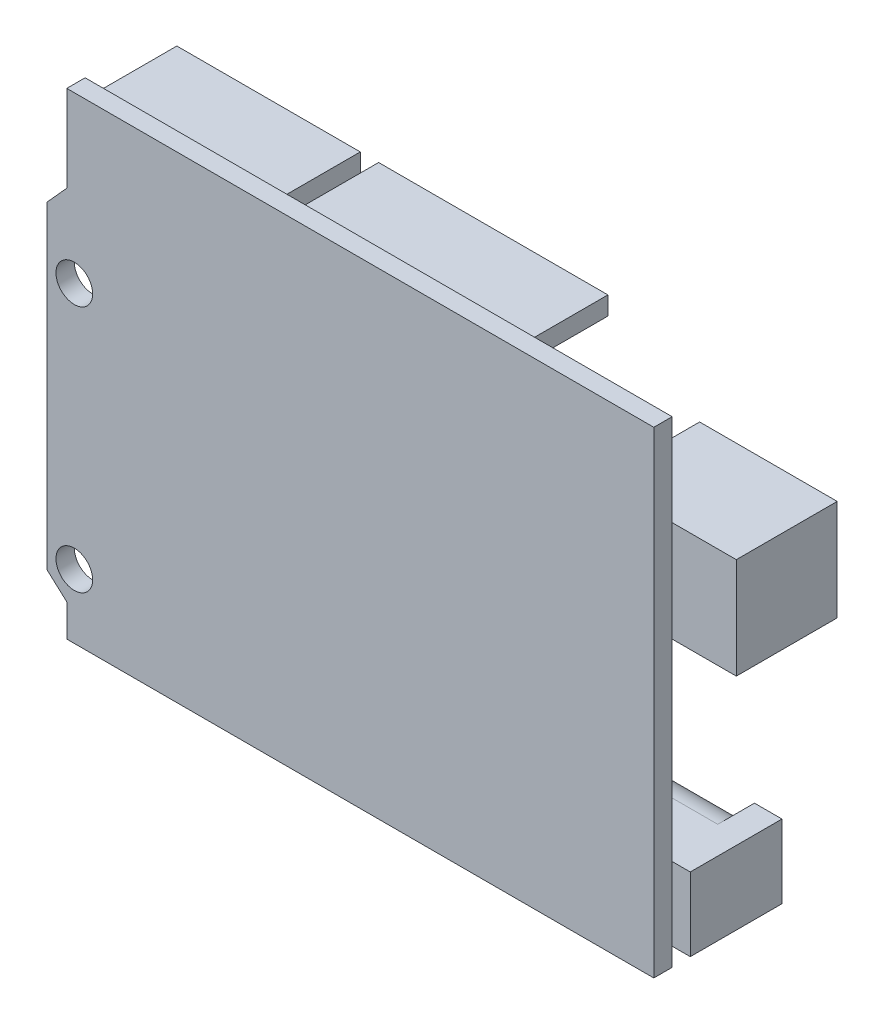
ISO-10303-21;
HEADER;
FILE_DESCRIPTION(('STEP AP214'),'2;1');
FILE_NAME('part.step','',(''),(''),'','','');
FILE_SCHEMA(('AUTOMOTIVE_DESIGN { 1 0 10303 214 1 1 1 1 }'));
ENDSEC;
DATA;
#1=APPLICATION_CONTEXT('core data for automotive mechanical design processes');
#2=APPLICATION_PROTOCOL_DEFINITION('international standard','automotive_design',2000,#1);
#3=PRODUCT_CONTEXT('',#1,'mechanical');
#4=PRODUCT('Part','Part','',(#3));
#5=PRODUCT_RELATED_PRODUCT_CATEGORY('part','',(#4));
#6=PRODUCT_DEFINITION_FORMATION('','',#4);
#7=PRODUCT_DEFINITION_CONTEXT('part definition',#1,'design');
#8=PRODUCT_DEFINITION('design','',#6,#7);
#9=PRODUCT_DEFINITION_SHAPE('','',#8);
#10=(LENGTH_UNIT() NAMED_UNIT(*) SI_UNIT(.MILLI.,.METRE.));
#11=(NAMED_UNIT(*) PLANE_ANGLE_UNIT() SI_UNIT($,.RADIAN.));
#12=(NAMED_UNIT(*) SI_UNIT($,.STERADIAN.) SOLID_ANGLE_UNIT());
#13=UNCERTAINTY_MEASURE_WITH_UNIT(LENGTH_MEASURE(1.E-05),#10,'distance_accuracy_value','');
#14=(GEOMETRIC_REPRESENTATION_CONTEXT(3) GLOBAL_UNCERTAINTY_ASSIGNED_CONTEXT((#13)) GLOBAL_UNIT_ASSIGNED_CONTEXT((#10,
#11,#12)) REPRESENTATION_CONTEXT('',''));
#15=CARTESIAN_POINT('',(0.,0.,0.));
#16=DIRECTION('',(0.,0.,1.));
#17=DIRECTION('',(1.,0.,0.));
#18=AXIS2_PLACEMENT_3D('',#15,#16,#17);
#19=CARTESIAN_POINT('',(52.9767933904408,-42.,-10.));
#20=DIRECTION('',(1.,0.,0.));
#21=DIRECTION('',(0.,0.,-1.));
#22=AXIS2_PLACEMENT_3D('',#19,#20,#21);
#23=PLANE('',#22);
#24=DIRECTION('',(0.,0.,1.));
#25=VECTOR('',#24,1.);
#26=CARTESIAN_POINT('',(52.9767933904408,-42.,-10.));
#27=LINE('',#26,#25);
#28=CARTESIAN_POINT('',(52.9767933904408,-42.,-6.));
#29=VERTEX_POINT('',#28);
#30=CARTESIAN_POINT('',(52.9767933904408,-42.,0.));
#31=VERTEX_POINT('',#30);
#32=EDGE_CURVE('E314',#29,#31,#27,.T.);
#33=ORIENTED_EDGE('',*,*,#32,.F.);
#34=CARTESIAN_POINT('',(52.9767933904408,-46.,-6.));
#35=DIRECTION('',(1.,0.,0.));
#36=DIRECTION('',(0.,0.,1.));
#37=AXIS2_PLACEMENT_3D('',#34,#35,#36);
#38=CIRCLE('',#37,4.);
#39=CARTESIAN_POINT('',(52.9767933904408,-50.,-6.));
#40=VERTEX_POINT('',#39);
#41=EDGE_CURVE('E274',#40,#29,#38,.T.);
#42=ORIENTED_EDGE('',*,*,#41,.F.);
#43=DIRECTION('',(0.,0.,1.));
#44=VECTOR('',#43,1.);
#45=CARTESIAN_POINT('',(52.9767933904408,-50.,-10.));
#46=LINE('',#45,#44);
#47=CARTESIAN_POINT('',(52.9767933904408,-50.,0.));
#48=VERTEX_POINT('',#47);
#49=EDGE_CURVE('E316',#40,#48,#46,.T.);
#50=ORIENTED_EDGE('',*,*,#49,.T.);
#51=DIRECTION('',(0.,1.,0.));
#52=VECTOR('',#51,1.);
#53=CARTESIAN_POINT('',(52.9767933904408,-42.,0.));
#54=LINE('',#53,#52);
#55=EDGE_CURVE('E307',#48,#31,#54,.T.);
#56=ORIENTED_EDGE('',*,*,#55,.T.);
#57=EDGE_LOOP('',(#33,#42,#50,#56));
#58=FACE_BOUND('',#57,.T.);
#59=ADVANCED_FACE('F33',(#58),#23,.F.);
#60=CARTESIAN_POINT('',(0.,0.,-10.));
#61=DIRECTION('',(0.,0.,-1.));
#62=DIRECTION('',(-1.,0.,0.));
#63=AXIS2_PLACEMENT_3D('',#60,#61,#62);
#64=PLANE('',#63);
#65=DIRECTION('',(-1.,0.,0.));
#66=VECTOR('',#65,1.);
#67=CARTESIAN_POINT('',(65.9767933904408,-50.,-10.));
#68=LINE('',#67,#66);
#69=CARTESIAN_POINT('',(65.9767933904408,-50.,-10.));
#70=VERTEX_POINT('',#69);
#71=CARTESIAN_POINT('',(62.9767933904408,-50.,-10.));
#72=VERTEX_POINT('',#71);
#73=EDGE_CURVE('E296',#70,#72,#68,.T.);
#74=ORIENTED_EDGE('',*,*,#73,.T.);
#75=DIRECTION('',(0.,1.,0.));
#76=VECTOR('',#75,1.);
#77=CARTESIAN_POINT('',(62.9767933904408,0.,-10.));
#78=LINE('',#77,#76);
#79=CARTESIAN_POINT('',(62.9767933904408,-46.,-10.));
#80=VERTEX_POINT('',#79);
#81=EDGE_CURVE('E11',#72,#80,#78,.T.);
#82=ORIENTED_EDGE('',*,*,#81,.T.);
#83=CARTESIAN_POINT('',(62.9767933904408,-42.,-10.));
#84=VERTEX_POINT('',#83);
#85=EDGE_CURVE('E37',#80,#84,#78,.T.);
#86=ORIENTED_EDGE('',*,*,#85,.T.);
#87=DIRECTION('',(1.,0.,0.));
#88=VECTOR('',#87,1.);
#89=CARTESIAN_POINT('',(65.9767933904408,-42.,-10.));
#90=LINE('',#89,#88);
#91=CARTESIAN_POINT('',(65.9767933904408,-42.,-10.));
#92=VERTEX_POINT('',#91);
#93=EDGE_CURVE('E286',#84,#92,#90,.T.);
#94=ORIENTED_EDGE('',*,*,#93,.T.);
#95=DIRECTION('',(0.,-1.,0.));
#96=VECTOR('',#95,1.);
#97=CARTESIAN_POINT('',(65.9767933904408,-42.,-10.));
#98=LINE('',#97,#96);
#99=EDGE_CURVE('E293',#92,#70,#98,.T.);
#100=ORIENTED_EDGE('',*,*,#99,.T.);
#101=EDGE_LOOP('',(#74,#82,#86,#94,#100));
#102=FACE_BOUND('',#101,.T.);
#103=ADVANCED_FACE('F569',(#102),#64,.T.);
#104=CARTESIAN_POINT('',(0.,0.,0.));
#105=DIRECTION('',(0.,0.,1.));
#106=DIRECTION('',(1.,0.,0.));
#107=AXIS2_PLACEMENT_3D('',#104,#105,#106);
#108=PLANE('',#107);
#109=DIRECTION('',(0.,1.,0.));
#110=VECTOR('',#109,1.);
#111=CARTESIAN_POINT('',(18.,-49.,0.));
#112=LINE('',#111,#110);
#113=CARTESIAN_POINT('',(18.,-51.,0.));
#114=VERTEX_POINT('',#113);
#115=CARTESIAN_POINT('',(18.,-49.,0.));
#116=VERTEX_POINT('',#115);
#117=EDGE_CURVE('E353',#114,#116,#112,.T.);
#118=ORIENTED_EDGE('',*,*,#117,.F.);
#119=DIRECTION('',(-1.,0.,0.));
#120=VECTOR('',#119,1.);
#121=CARTESIAN_POINT('',(18.,-51.,0.));
#122=LINE('',#121,#120);
#123=CARTESIAN_POINT('',(38.,-51.,0.));
#124=VERTEX_POINT('',#123);
#125=EDGE_CURVE('E364',#124,#114,#122,.T.);
#126=ORIENTED_EDGE('',*,*,#125,.F.);
#127=DIRECTION('',(0.,-1.,0.));
#128=VECTOR('',#127,1.);
#129=CARTESIAN_POINT('',(38.,-49.,0.));
#130=LINE('',#129,#128);
#131=CARTESIAN_POINT('',(38.,-49.,0.));
#132=VERTEX_POINT('',#131);
#133=EDGE_CURVE('E376',#132,#124,#130,.T.);
#134=ORIENTED_EDGE('',*,*,#133,.F.);
#135=DIRECTION('',(1.,0.,0.));
#136=VECTOR('',#135,1.);
#137=CARTESIAN_POINT('',(18.,-49.,0.));
#138=LINE('',#137,#136);
#139=EDGE_CURVE('E373',#116,#132,#138,.T.);
#140=ORIENTED_EDGE('',*,*,#139,.F.);
#141=EDGE_LOOP('',(#118,#126,#134,#140));
#142=FACE_BOUND('',#141,.T.);
#143=DIRECTION('',(0.,1.,0.));
#144=VECTOR('',#143,1.);
#145=CARTESIAN_POINT('',(23.,-1.,0.));
#146=LINE('',#145,#144);
#147=CARTESIAN_POINT('',(23.,-3.,0.));
#148=VERTEX_POINT('',#147);
#149=CARTESIAN_POINT('',(23.,-1.,0.));
#150=VERTEX_POINT('',#149);
#151=EDGE_CURVE('E425',#148,#150,#146,.T.);
#152=ORIENTED_EDGE('',*,*,#151,.F.);
#153=DIRECTION('',(-1.,0.,0.));
#154=VECTOR('',#153,1.);
#155=CARTESIAN_POINT('',(23.,-3.,0.));
#156=LINE('',#155,#154);
#157=CARTESIAN_POINT('',(48.,-3.,0.));
#158=VERTEX_POINT('',#157);
#159=EDGE_CURVE('E430',#158,#148,#156,.T.);
#160=ORIENTED_EDGE('',*,*,#159,.F.);
#161=DIRECTION('',(0.,-1.,0.));
#162=VECTOR('',#161,1.);
#163=CARTESIAN_POINT('',(48.,-1.,0.));
#164=LINE('',#163,#162);
#165=CARTESIAN_POINT('',(48.,-1.,0.));
#166=VERTEX_POINT('',#165);
#167=EDGE_CURVE('E442',#166,#158,#164,.T.);
#168=ORIENTED_EDGE('',*,*,#167,.F.);
#169=DIRECTION('',(1.,0.,0.));
#170=VECTOR('',#169,1.);
#171=CARTESIAN_POINT('',(23.,-1.,0.));
#172=LINE('',#171,#170);
#173=EDGE_CURVE('E439',#150,#166,#172,.T.);
#174=ORIENTED_EDGE('',*,*,#173,.F.);
#175=EDGE_LOOP('',(#152,#160,#168,#174));
#176=FACE_BOUND('',#175,.T.);
#177=DIRECTION('',(0.,-1.,0.));
#178=VECTOR('',#177,1.);
#179=CARTESIAN_POINT('',(21.,-1.,0.));
#180=LINE('',#179,#178);
#181=CARTESIAN_POINT('',(21.,-1.,0.));
#182=VERTEX_POINT('',#181);
#183=CARTESIAN_POINT('',(21.,-3.,0.));
#184=VERTEX_POINT('',#183);
#185=EDGE_CURVE('E458',#182,#184,#180,.T.);
#186=ORIENTED_EDGE('',*,*,#185,.F.);
#187=DIRECTION('',(1.,0.,0.));
#188=VECTOR('',#187,1.);
#189=CARTESIAN_POINT('',(21.,-1.,0.));
#190=LINE('',#189,#188);
#191=CARTESIAN_POINT('',(1.,-1.,0.));
#192=VERTEX_POINT('',#191);
#193=EDGE_CURVE('E463',#192,#182,#190,.T.);
#194=ORIENTED_EDGE('',*,*,#193,.F.);
#195=DIRECTION('',(0.,1.,0.));
#196=VECTOR('',#195,1.);
#197=CARTESIAN_POINT('',(1.,-1.,0.));
#198=LINE('',#197,#196);
#199=CARTESIAN_POINT('',(1.,-3.,0.));
#200=VERTEX_POINT('',#199);
#201=EDGE_CURVE('E475',#200,#192,#198,.T.);
#202=ORIENTED_EDGE('',*,*,#201,.F.);
#203=DIRECTION('',(-1.,0.,0.));
#204=VECTOR('',#203,1.);
#205=CARTESIAN_POINT('',(21.,-3.,0.));
#206=LINE('',#205,#204);
#207=EDGE_CURVE('E472',#184,#200,#206,.T.);
#208=ORIENTED_EDGE('',*,*,#207,.F.);
#209=EDGE_LOOP('',(#186,#194,#202,#208));
#210=FACE_BOUND('',#209,.T.);
#211=DIRECTION('',(0.,-1.,0.));
#212=VECTOR('',#211,1.);
#213=CARTESIAN_POINT('',(16.,-49.,0.));
#214=LINE('',#213,#212);
#215=CARTESIAN_POINT('',(16.,-49.,0.));
#216=VERTEX_POINT('',#215);
#217=CARTESIAN_POINT('',(16.,-51.,0.));
#218=VERTEX_POINT('',#217);
#219=EDGE_CURVE('E392',#216,#218,#214,.T.);
#220=ORIENTED_EDGE('',*,*,#219,.F.);
#221=DIRECTION('',(1.,0.,0.));
#222=VECTOR('',#221,1.);
#223=CARTESIAN_POINT('',(16.,-49.,0.));
#224=LINE('',#223,#222);
#225=CARTESIAN_POINT('',(1.,-49.,0.));
#226=VERTEX_POINT('',#225);
#227=EDGE_CURVE('E397',#226,#216,#224,.T.);
#228=ORIENTED_EDGE('',*,*,#227,.F.);
#229=DIRECTION('',(0.,1.,0.));
#230=VECTOR('',#229,1.);
#231=CARTESIAN_POINT('',(1.,-49.,0.));
#232=LINE('',#231,#230);
#233=CARTESIAN_POINT('',(1.,-51.,0.));
#234=VERTEX_POINT('',#233);
#235=EDGE_CURVE('E409',#234,#226,#232,.T.);
#236=ORIENTED_EDGE('',*,*,#235,.F.);
#237=DIRECTION('',(-1.,0.,0.));
#238=VECTOR('',#237,1.);
#239=CARTESIAN_POINT('',(16.,-51.,0.));
#240=LINE('',#239,#238);
#241=EDGE_CURVE('E406',#218,#234,#240,.T.);
#242=ORIENTED_EDGE('',*,*,#241,.F.);
#243=EDGE_LOOP('',(#220,#228,#236,#242));
#244=FACE_BOUND('',#243,.T.);
#245=CARTESIAN_POINT('',(0.821732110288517,-45.,0.));
#246=DIRECTION('',(0.,0.,-1.));
#247=DIRECTION('',(-1.,0.,0.));
#248=AXIS2_PLACEMENT_3D('',#245,#246,#247);
#249=CIRCLE('',#248,2.);
#250=CARTESIAN_POINT('',(-1.17826788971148,-45.,0.));
#251=VERTEX_POINT('',#250);
#252=EDGE_CURVE('E321',#251,#251,#249,.T.);
#253=ORIENTED_EDGE('',*,*,#252,.F.);
#254=EDGE_LOOP('',(#253));
#255=FACE_BOUND('',#254,.T.);
#256=CARTESIAN_POINT('',(0.821732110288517,-18.,0.));
#257=DIRECTION('',(0.,0.,-1.));
#258=DIRECTION('',(-1.,0.,0.));
#259=AXIS2_PLACEMENT_3D('',#256,#257,#258);
#260=CIRCLE('',#259,2.);
#261=CARTESIAN_POINT('',(-1.17826788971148,-18.,0.));
#262=VERTEX_POINT('',#261);
#263=EDGE_CURVE('E326',#262,#262,#260,.T.);
#264=ORIENTED_EDGE('',*,*,#263,.F.);
#265=EDGE_LOOP('',(#264));
#266=FACE_BOUND('',#265,.T.);
#267=DIRECTION('',(-1.,0.,0.));
#268=VECTOR('',#267,1.);
#269=CARTESIAN_POINT('',(65.9767933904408,-50.,0.));
#270=LINE('',#269,#268);
#271=CARTESIAN_POINT('',(64.,-50.,0.));
#272=VERTEX_POINT('',#271);
#273=EDGE_CURVE('E303',#272,#48,#270,.T.);
#274=ORIENTED_EDGE('',*,*,#273,.F.);
#275=DIRECTION('',(0.,1.,0.));
#276=VECTOR('',#275,1.);
#277=CARTESIAN_POINT('',(64.,0.,0.));
#278=LINE('',#277,#276);
#279=CARTESIAN_POINT('',(64.,-52.,0.));
#280=VERTEX_POINT('',#279);
#281=EDGE_CURVE('E544',#280,#272,#278,.T.);
#282=ORIENTED_EDGE('',*,*,#281,.F.);
#283=DIRECTION('',(1.,0.,0.));
#284=VECTOR('',#283,1.);
#285=CARTESIAN_POINT('',(0.,-52.,0.));
#286=LINE('',#285,#284);
#287=CARTESIAN_POINT('',(0.,-52.,0.));
#288=VERTEX_POINT('',#287);
#289=EDGE_CURVE('E541',#288,#280,#286,.T.);
#290=ORIENTED_EDGE('',*,*,#289,.F.);
#291=DIRECTION('',(0.,-1.,0.));
#292=VECTOR('',#291,1.);
#293=CARTESIAN_POINT('',(0.,0.,0.));
#294=LINE('',#293,#292);
#295=CARTESIAN_POINT('',(0.,-48.4792406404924,0.));
#296=VERTEX_POINT('',#295);
#297=EDGE_CURVE('E526',#296,#288,#294,.T.);
#298=ORIENTED_EDGE('',*,*,#297,.F.);
#299=DIRECTION('',(-0.742560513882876,0.669778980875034,0.));
#300=VECTOR('',#299,1.);
#301=CARTESIAN_POINT('',(0.,-48.4792406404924,0.));
#302=LINE('',#301,#300);
#303=CARTESIAN_POINT('',(-2.17826788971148,-46.514474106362,0.));
#304=VERTEX_POINT('',#303);
#305=EDGE_CURVE('E325',#296,#304,#302,.T.);
#306=ORIENTED_EDGE('',*,*,#305,.T.);
#307=DIRECTION('',(0.,1.,0.));
#308=VECTOR('',#307,1.);
#309=CARTESIAN_POINT('',(-2.17826788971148,-46.514474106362,0.));
#310=LINE('',#309,#308);
#311=CARTESIAN_POINT('',(-2.17826788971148,-11.8421235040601,0.));
#312=VERTEX_POINT('',#311);
#313=EDGE_CURVE('E346',#304,#312,#310,.T.);
#314=ORIENTED_EDGE('',*,*,#313,.T.);
#315=DIRECTION('',(0.669778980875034,0.742560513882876,0.));
#316=VECTOR('',#315,1.);
#317=CARTESIAN_POINT('',(-2.17826788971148,-11.8421235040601,0.));
#318=LINE('',#317,#316);
#319=CARTESIAN_POINT('',(0.,-9.42715413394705,0.));
#320=VERTEX_POINT('',#319);
#321=EDGE_CURVE('E338',#312,#320,#318,.T.);
#322=ORIENTED_EDGE('',*,*,#321,.T.);
#323=CARTESIAN_POINT('',(0.,0.,0.));
#324=VERTEX_POINT('',#323);
#325=EDGE_CURVE('E538',#324,#320,#294,.T.);
#326=ORIENTED_EDGE('',*,*,#325,.F.);
#327=DIRECTION('',(-1.,0.,0.));
#328=VECTOR('',#327,1.);
#329=CARTESIAN_POINT('',(0.,0.,0.));
#330=LINE('',#329,#328);
#331=CARTESIAN_POINT('',(64.,0.,0.));
#332=VERTEX_POINT('',#331);
#333=EDGE_CURVE('E547',#332,#324,#330,.T.);
#334=ORIENTED_EDGE('',*,*,#333,.F.);
#335=CARTESIAN_POINT('',(64.,-9.99999999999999,0.));
#336=VERTEX_POINT('',#335);
#337=EDGE_CURVE('E543',#336,#332,#278,.T.);
#338=ORIENTED_EDGE('',*,*,#337,.F.);
#339=DIRECTION('',(1.,0.,0.));
#340=VECTOR('',#339,1.);
#341=CARTESIAN_POINT('',(70.9980395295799,-10.,0.));
#342=LINE('',#341,#340);
#343=CARTESIAN_POINT('',(55.9980395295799,-10.,0.));
#344=VERTEX_POINT('',#343);
#345=EDGE_CURVE('E496',#344,#336,#342,.T.);
#346=ORIENTED_EDGE('',*,*,#345,.F.);
#347=DIRECTION('',(0.,1.,0.));
#348=VECTOR('',#347,1.);
#349=CARTESIAN_POINT('',(55.9980395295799,-10.,0.));
#350=LINE('',#349,#348);
#351=CARTESIAN_POINT('',(55.9980395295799,-21.,0.));
#352=VERTEX_POINT('',#351);
#353=EDGE_CURVE('E508',#352,#344,#350,.T.);
#354=ORIENTED_EDGE('',*,*,#353,.F.);
#355=DIRECTION('',(-1.,0.,0.));
#356=VECTOR('',#355,1.);
#357=CARTESIAN_POINT('',(70.9980395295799,-21.,0.));
#358=LINE('',#357,#356);
#359=CARTESIAN_POINT('',(64.,-21.,0.));
#360=VERTEX_POINT('',#359);
#361=EDGE_CURVE('E509',#360,#352,#358,.T.);
#362=ORIENTED_EDGE('',*,*,#361,.F.);
#363=CARTESIAN_POINT('',(64.,-42.,0.));
#364=VERTEX_POINT('',#363);
#365=EDGE_CURVE('E549',#364,#360,#278,.T.);
#366=ORIENTED_EDGE('',*,*,#365,.F.);
#367=DIRECTION('',(1.,0.,0.));
#368=VECTOR('',#367,1.);
#369=CARTESIAN_POINT('',(65.9767933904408,-42.,0.));
#370=LINE('',#369,#368);
#371=EDGE_CURVE('E56',#31,#364,#370,.T.);
#372=ORIENTED_EDGE('',*,*,#371,.F.);
#373=ORIENTED_EDGE('',*,*,#55,.F.);
#374=EDGE_LOOP('',(#274,#282,#290,#298,#306,#314,#322,#326,#334,#338,#346,#354,#362,#366,#372,#373));
#375=FACE_BOUND('',#374,.T.);
#376=ADVANCED_FACE('F584',(#142,#176,#210,#244,#255,#266,#375),#108,.F.);
#377=CARTESIAN_POINT('',(0.,0.,2.));
#378=DIRECTION('',(1.,0.,0.));
#379=DIRECTION('',(0.,1.,0.));
#380=AXIS2_PLACEMENT_3D('',#377,#378,#379);
#381=PLANE('',#380);
#382=DIRECTION('',(0.,0.,-1.));
#383=VECTOR('',#382,1.);
#384=CARTESIAN_POINT('',(0.,-9.42715413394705,2.));
#385=LINE('',#384,#383);
#386=CARTESIAN_POINT('',(0.,-9.42715413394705,2.));
#387=VERTEX_POINT('',#386);
#388=EDGE_CURVE('E351',#387,#320,#385,.T.);
#389=ORIENTED_EDGE('',*,*,#388,.F.);
#390=DIRECTION('',(0.,-1.,0.));
#391=VECTOR('',#390,1.);
#392=CARTESIAN_POINT('',(0.,0.,2.));
#393=LINE('',#392,#391);
#394=CARTESIAN_POINT('',(0.,0.,2.));
#395=VERTEX_POINT('',#394);
#396=EDGE_CURVE('E527',#395,#387,#393,.T.);
#397=ORIENTED_EDGE('',*,*,#396,.F.);
#398=DIRECTION('',(0.,0.,-1.));
#399=VECTOR('',#398,1.);
#400=CARTESIAN_POINT('',(0.,0.,2.));
#401=LINE('',#400,#399);
#402=EDGE_CURVE('E537',#395,#324,#401,.T.);
#403=ORIENTED_EDGE('',*,*,#402,.T.);
#404=ORIENTED_EDGE('',*,*,#325,.T.);
#405=EDGE_LOOP('',(#389,#397,#403,#404));
#406=FACE_BOUND('',#405,.T.);
#407=ADVANCED_FACE('F933',(#406),#381,.F.);
#408=CARTESIAN_POINT('',(0.,-48.4792406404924,2.));
#409=VERTEX_POINT('',#408);
#410=CARTESIAN_POINT('',(0.,-52.,2.));
#411=VERTEX_POINT('',#410);
#412=EDGE_CURVE('E531',#409,#411,#393,.T.);
#413=ORIENTED_EDGE('',*,*,#412,.F.);
#414=DIRECTION('',(0.,0.,-1.));
#415=VECTOR('',#414,1.);
#416=CARTESIAN_POINT('',(0.,-48.4792406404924,2.));
#417=LINE('',#416,#415);
#418=EDGE_CURVE('E343',#409,#296,#417,.T.);
#419=ORIENTED_EDGE('',*,*,#418,.T.);
#420=ORIENTED_EDGE('',*,*,#297,.T.);
#421=DIRECTION('',(0.,0.,-1.));
#422=VECTOR('',#421,1.);
#423=CARTESIAN_POINT('',(0.,-52.,2.));
#424=LINE('',#423,#422);
#425=EDGE_CURVE('E559',#411,#288,#424,.T.);
#426=ORIENTED_EDGE('',*,*,#425,.F.);
#427=EDGE_LOOP('',(#413,#419,#420,#426));
#428=FACE_BOUND('',#427,.T.);
#429=ADVANCED_FACE('F35',(#428),#381,.F.);
#430=CARTESIAN_POINT('',(0.,-52.,2.));
#431=DIRECTION('',(0.,1.,0.));
#432=DIRECTION('',(0.,0.,1.));
#433=AXIS2_PLACEMENT_3D('',#430,#431,#432);
#434=PLANE('',#433);
#435=ORIENTED_EDGE('',*,*,#289,.T.);
#436=DIRECTION('',(0.,0.,-1.));
#437=VECTOR('',#436,1.);
#438=CARTESIAN_POINT('',(64.,-52.,2.));
#439=LINE('',#438,#437);
#440=CARTESIAN_POINT('',(64.,-52.,2.));
#441=VERTEX_POINT('',#440);
#442=EDGE_CURVE('E557',#441,#280,#439,.T.);
#443=ORIENTED_EDGE('',*,*,#442,.F.);
#444=DIRECTION('',(1.,0.,0.));
#445=VECTOR('',#444,1.);
#446=CARTESIAN_POINT('',(0.,-52.,2.));
#447=LINE('',#446,#445);
#448=EDGE_CURVE('E530',#411,#441,#447,.T.);
#449=ORIENTED_EDGE('',*,*,#448,.F.);
#450=ORIENTED_EDGE('',*,*,#425,.T.);
#451=EDGE_LOOP('',(#435,#443,#449,#450));
#452=FACE_BOUND('',#451,.T.);
#453=ADVANCED_FACE('F944',(#452),#434,.F.);
#454=CARTESIAN_POINT('',(64.,0.,2.));
#455=DIRECTION('',(-1.,0.,0.));
#456=DIRECTION('',(0.,0.,1.));
#457=AXIS2_PLACEMENT_3D('',#454,#455,#456);
#458=PLANE('',#457);
#459=ORIENTED_EDGE('',*,*,#281,.T.);
#460=EDGE_CURVE('E548',#272,#364,#278,.T.);
#461=ORIENTED_EDGE('',*,*,#460,.T.);
#462=ORIENTED_EDGE('',*,*,#365,.T.);
#463=EDGE_CURVE('E550',#360,#336,#278,.T.);
#464=ORIENTED_EDGE('',*,*,#463,.T.);
#465=ORIENTED_EDGE('',*,*,#337,.T.);
#466=DIRECTION('',(0.,0.,-1.));
#467=VECTOR('',#466,1.);
#468=CARTESIAN_POINT('',(64.,0.,2.));
#469=LINE('',#468,#467);
#470=CARTESIAN_POINT('',(64.,0.,2.));
#471=VERTEX_POINT('',#470);
#472=EDGE_CURVE('E554',#471,#332,#469,.T.);
#473=ORIENTED_EDGE('',*,*,#472,.F.);
#474=DIRECTION('',(0.,1.,0.));
#475=VECTOR('',#474,1.);
#476=CARTESIAN_POINT('',(64.,0.,2.));
#477=LINE('',#476,#475);
#478=EDGE_CURVE('E533',#441,#471,#477,.T.);
#479=ORIENTED_EDGE('',*,*,#478,.F.);
#480=ORIENTED_EDGE('',*,*,#442,.T.);
#481=EDGE_LOOP('',(#459,#461,#462,#464,#465,#473,#479,#480));
#482=FACE_BOUND('',#481,.T.);
#483=ADVANCED_FACE('F589',(#482),#458,.F.);
#484=CARTESIAN_POINT('',(0.,0.,2.));
#485=DIRECTION('',(0.,-1.,0.));
#486=DIRECTION('',(0.,0.,-1.));
#487=AXIS2_PLACEMENT_3D('',#484,#485,#486);
#488=PLANE('',#487);
#489=ORIENTED_EDGE('',*,*,#333,.T.);
#490=ORIENTED_EDGE('',*,*,#402,.F.);
#491=DIRECTION('',(-1.,0.,0.));
#492=VECTOR('',#491,1.);
#493=CARTESIAN_POINT('',(0.,0.,2.));
#494=LINE('',#493,#492);
#495=EDGE_CURVE('E535',#471,#395,#494,.T.);
#496=ORIENTED_EDGE('',*,*,#495,.F.);
#497=ORIENTED_EDGE('',*,*,#472,.T.);
#498=EDGE_LOOP('',(#489,#490,#496,#497));
#499=FACE_BOUND('',#498,.T.);
#500=ADVANCED_FACE('F621',(#499),#488,.F.);
#501=CARTESIAN_POINT('',(0.,0.,2.));
#502=DIRECTION('',(0.,0.,1.));
#503=DIRECTION('',(1.,0.,0.));
#504=AXIS2_PLACEMENT_3D('',#501,#502,#503);
#505=PLANE('',#504);
#506=CARTESIAN_POINT('',(0.821732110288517,-18.,2.));
#507=DIRECTION('',(0.,0.,-1.));
#508=DIRECTION('',(-1.,0.,0.));
#509=AXIS2_PLACEMENT_3D('',#506,#507,#508);
#510=CIRCLE('',#509,2.);
#511=CARTESIAN_POINT('',(-1.17826788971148,-18.,2.));
#512=VERTEX_POINT('',#511);
#513=EDGE_CURVE('E322',#512,#512,#510,.T.);
#514=ORIENTED_EDGE('',*,*,#513,.T.);
#515=EDGE_LOOP('',(#514));
#516=FACE_BOUND('',#515,.T.);
#517=CARTESIAN_POINT('',(0.821732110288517,-45.,2.));
#518=DIRECTION('',(0.,0.,-1.));
#519=DIRECTION('',(-1.,0.,0.));
#520=AXIS2_PLACEMENT_3D('',#517,#518,#519);
#521=CIRCLE('',#520,2.);
#522=CARTESIAN_POINT('',(-1.17826788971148,-45.,2.));
#523=VERTEX_POINT('',#522);
#524=EDGE_CURVE('E329',#523,#523,#521,.T.);
#525=ORIENTED_EDGE('',*,*,#524,.T.);
#526=EDGE_LOOP('',(#525));
#527=FACE_BOUND('',#526,.T.);
#528=ORIENTED_EDGE('',*,*,#396,.T.);
#529=DIRECTION('',(0.669778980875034,0.742560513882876,0.));
#530=VECTOR('',#529,1.);
#531=CARTESIAN_POINT('',(-2.17826788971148,-11.8421235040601,2.));
#532=LINE('',#531,#530);
#533=CARTESIAN_POINT('',(-2.17826788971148,-11.8421235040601,2.));
#534=VERTEX_POINT('',#533);
#535=EDGE_CURVE('E341',#534,#387,#532,.T.);
#536=ORIENTED_EDGE('',*,*,#535,.F.);
#537=DIRECTION('',(0.,1.,0.));
#538=VECTOR('',#537,1.);
#539=CARTESIAN_POINT('',(-2.17826788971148,-46.514474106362,2.));
#540=LINE('',#539,#538);
#541=CARTESIAN_POINT('',(-2.17826788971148,-46.514474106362,2.));
#542=VERTEX_POINT('',#541);
#543=EDGE_CURVE('E337',#542,#534,#540,.T.);
#544=ORIENTED_EDGE('',*,*,#543,.F.);
#545=DIRECTION('',(-0.742560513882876,0.669778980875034,0.));
#546=VECTOR('',#545,1.);
#547=CARTESIAN_POINT('',(0.,-48.4792406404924,2.));
#548=LINE('',#547,#546);
#549=EDGE_CURVE('E334',#409,#542,#548,.T.);
#550=ORIENTED_EDGE('',*,*,#549,.F.);
#551=ORIENTED_EDGE('',*,*,#412,.T.);
#552=ORIENTED_EDGE('',*,*,#448,.T.);
#553=ORIENTED_EDGE('',*,*,#478,.T.);
#554=ORIENTED_EDGE('',*,*,#495,.T.);
#555=EDGE_LOOP('',(#528,#536,#544,#550,#551,#552,#553,#554));
#556=FACE_BOUND('',#555,.T.);
#557=ADVANCED_FACE('F614',(#516,#527,#556),#505,.T.);
#558=CARTESIAN_POINT('',(70.9980395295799,-10.,-11.));
#559=DIRECTION('',(-1.,0.,0.));
#560=DIRECTION('',(0.,0.,1.));
#561=AXIS2_PLACEMENT_3D('',#558,#559,#560);
#562=PLANE('',#561);
#563=DIRECTION('',(0.,-1.,0.));
#564=VECTOR('',#563,1.);
#565=CARTESIAN_POINT('',(70.9980395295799,-10.,0.));
#566=LINE('',#565,#564);
#567=CARTESIAN_POINT('',(70.9980395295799,-10.,0.));
#568=VERTEX_POINT('',#567);
#569=CARTESIAN_POINT('',(70.9980395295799,-21.,0.));
#570=VERTEX_POINT('',#569);
#571=EDGE_CURVE('E491',#568,#570,#566,.T.);
#572=ORIENTED_EDGE('',*,*,#571,.T.);
#573=DIRECTION('',(0.,0.,1.));
#574=VECTOR('',#573,1.);
#575=CARTESIAN_POINT('',(70.9980395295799,-21.,-11.));
#576=LINE('',#575,#574);
#577=CARTESIAN_POINT('',(70.9980395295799,-21.,-11.));
#578=VERTEX_POINT('',#577);
#579=EDGE_CURVE('E523',#578,#570,#576,.T.);
#580=ORIENTED_EDGE('',*,*,#579,.F.);
#581=DIRECTION('',(0.,-1.,0.));
#582=VECTOR('',#581,1.);
#583=CARTESIAN_POINT('',(70.9980395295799,-10.,-11.));
#584=LINE('',#583,#582);
#585=CARTESIAN_POINT('',(70.9980395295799,-10.,-11.));
#586=VERTEX_POINT('',#585);
#587=EDGE_CURVE('E492',#586,#578,#584,.T.);
#588=ORIENTED_EDGE('',*,*,#587,.F.);
#589=DIRECTION('',(0.,0.,1.));
#590=VECTOR('',#589,1.);
#591=CARTESIAN_POINT('',(70.9980395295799,-10.,-11.));
#592=LINE('',#591,#590);
#593=EDGE_CURVE('E502',#586,#568,#592,.T.);
#594=ORIENTED_EDGE('',*,*,#593,.T.);
#595=EDGE_LOOP('',(#572,#580,#588,#594));
#596=FACE_BOUND('',#595,.T.);
#597=ADVANCED_FACE('F612',(#596),#562,.F.);
#598=CARTESIAN_POINT('',(70.9980395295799,-21.,-11.));
#599=DIRECTION('',(0.,1.,0.));
#600=DIRECTION('',(0.,0.,1.));
#601=AXIS2_PLACEMENT_3D('',#598,#599,#600);
#602=PLANE('',#601);
#603=EDGE_CURVE('E505',#570,#360,#358,.T.);
#604=ORIENTED_EDGE('',*,*,#603,.T.);
#605=ORIENTED_EDGE('',*,*,#361,.T.);
#606=DIRECTION('',(0.,0.,1.));
#607=VECTOR('',#606,1.);
#608=CARTESIAN_POINT('',(55.9980395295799,-21.,-11.));
#609=LINE('',#608,#607);
#610=CARTESIAN_POINT('',(55.9980395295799,-21.,-11.));
#611=VERTEX_POINT('',#610);
#612=EDGE_CURVE('E520',#611,#352,#609,.T.);
#613=ORIENTED_EDGE('',*,*,#612,.F.);
#614=DIRECTION('',(-1.,0.,0.));
#615=VECTOR('',#614,1.);
#616=CARTESIAN_POINT('',(70.9980395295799,-21.,-11.));
#617=LINE('',#616,#615);
#618=EDGE_CURVE('E495',#578,#611,#617,.T.);
#619=ORIENTED_EDGE('',*,*,#618,.F.);
#620=ORIENTED_EDGE('',*,*,#579,.T.);
#621=EDGE_LOOP('',(#604,#605,#613,#619,#620));
#622=FACE_BOUND('',#621,.T.);
#623=ADVANCED_FACE('F606',(#622),#602,.F.);
#624=CARTESIAN_POINT('',(55.9980395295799,-10.,-11.));
#625=DIRECTION('',(1.,0.,0.));
#626=DIRECTION('',(0.,0.,-1.));
#627=AXIS2_PLACEMENT_3D('',#624,#625,#626);
#628=PLANE('',#627);
#629=ORIENTED_EDGE('',*,*,#353,.T.);
#630=DIRECTION('',(0.,0.,1.));
#631=VECTOR('',#630,1.);
#632=CARTESIAN_POINT('',(55.9980395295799,-10.,-11.));
#633=LINE('',#632,#631);
#634=CARTESIAN_POINT('',(55.9980395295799,-10.,-11.));
#635=VERTEX_POINT('',#634);
#636=EDGE_CURVE('E517',#635,#344,#633,.T.);
#637=ORIENTED_EDGE('',*,*,#636,.F.);
#638=DIRECTION('',(0.,1.,0.));
#639=VECTOR('',#638,1.);
#640=CARTESIAN_POINT('',(55.9980395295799,-10.,-11.));
#641=LINE('',#640,#639);
#642=EDGE_CURVE('E498',#611,#635,#641,.T.);
#643=ORIENTED_EDGE('',*,*,#642,.F.);
#644=ORIENTED_EDGE('',*,*,#612,.T.);
#645=EDGE_LOOP('',(#629,#637,#643,#644));
#646=FACE_BOUND('',#645,.T.);
#647=ADVANCED_FACE('F604',(#646),#628,.F.);
#648=CARTESIAN_POINT('',(70.9980395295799,-10.,-11.));
#649=DIRECTION('',(0.,-1.,0.));
#650=DIRECTION('',(1.,0.,0.));
#651=AXIS2_PLACEMENT_3D('',#648,#649,#650);
#652=PLANE('',#651);
#653=ORIENTED_EDGE('',*,*,#345,.T.);
#654=EDGE_CURVE('E512',#336,#568,#342,.T.);
#655=ORIENTED_EDGE('',*,*,#654,.T.);
#656=ORIENTED_EDGE('',*,*,#593,.F.);
#657=DIRECTION('',(1.,0.,0.));
#658=VECTOR('',#657,1.);
#659=CARTESIAN_POINT('',(70.9980395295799,-10.,-11.));
#660=LINE('',#659,#658);
#661=EDGE_CURVE('E500',#635,#586,#660,.T.);
#662=ORIENTED_EDGE('',*,*,#661,.F.);
#663=ORIENTED_EDGE('',*,*,#636,.T.);
#664=EDGE_LOOP('',(#653,#655,#656,#662,#663));
#665=FACE_BOUND('',#664,.T.);
#666=ADVANCED_FACE('F599',(#665),#652,.F.);
#667=CARTESIAN_POINT('',(0.,0.,-11.));
#668=DIRECTION('',(0.,0.,-1.));
#669=DIRECTION('',(-1.,0.,0.));
#670=AXIS2_PLACEMENT_3D('',#667,#668,#669);
#671=PLANE('',#670);
#672=ORIENTED_EDGE('',*,*,#587,.T.);
#673=ORIENTED_EDGE('',*,*,#618,.T.);
#674=ORIENTED_EDGE('',*,*,#642,.T.);
#675=ORIENTED_EDGE('',*,*,#661,.T.);
#676=EDGE_LOOP('',(#672,#673,#674,#675));
#677=FACE_BOUND('',#676,.T.);
#678=ADVANCED_FACE('F610',(#677),#671,.T.);
#679=CARTESIAN_POINT('',(0.,0.,0.));
#680=DIRECTION('',(0.,0.,-1.));
#681=DIRECTION('',(-1.,0.,0.));
#682=AXIS2_PLACEMENT_3D('',#679,#680,#681);
#683=PLANE('',#682);
#684=ORIENTED_EDGE('',*,*,#463,.F.);
#685=ORIENTED_EDGE('',*,*,#603,.F.);
#686=ORIENTED_EDGE('',*,*,#571,.F.);
#687=ORIENTED_EDGE('',*,*,#654,.F.);
#688=EDGE_LOOP('',(#684,#685,#686,#687));
#689=FACE_BOUND('',#688,.T.);
#690=ADVANCED_FACE('F596',(#689),#683,.F.);
#691=CARTESIAN_POINT('',(21.,-1.,-9.));
#692=DIRECTION('',(-1.,0.,0.));
#693=DIRECTION('',(0.,0.,1.));
#694=AXIS2_PLACEMENT_3D('',#691,#692,#693);
#695=PLANE('',#694);
#696=ORIENTED_EDGE('',*,*,#185,.T.);
#697=DIRECTION('',(0.,0.,1.));
#698=VECTOR('',#697,1.);
#699=CARTESIAN_POINT('',(21.,-3.,-9.));
#700=LINE('',#699,#698);
#701=CARTESIAN_POINT('',(21.,-3.,-9.));
#702=VERTEX_POINT('',#701);
#703=EDGE_CURVE('E488',#702,#184,#700,.T.);
#704=ORIENTED_EDGE('',*,*,#703,.F.);
#705=DIRECTION('',(0.,-1.,0.));
#706=VECTOR('',#705,1.);
#707=CARTESIAN_POINT('',(21.,-1.,-9.));
#708=LINE('',#707,#706);
#709=CARTESIAN_POINT('',(21.,-1.,-9.));
#710=VERTEX_POINT('',#709);
#711=EDGE_CURVE('E459',#710,#702,#708,.T.);
#712=ORIENTED_EDGE('',*,*,#711,.F.);
#713=DIRECTION('',(0.,0.,1.));
#714=VECTOR('',#713,1.);
#715=CARTESIAN_POINT('',(21.,-1.,-9.));
#716=LINE('',#715,#714);
#717=EDGE_CURVE('E469',#710,#182,#716,.T.);
#718=ORIENTED_EDGE('',*,*,#717,.T.);
#719=EDGE_LOOP('',(#696,#704,#712,#718));
#720=FACE_BOUND('',#719,.T.);
#721=ADVANCED_FACE('F735',(#720),#695,.F.);
#722=CARTESIAN_POINT('',(21.,-3.,-9.));
#723=DIRECTION('',(0.,1.,0.));
#724=DIRECTION('',(0.,0.,1.));
#725=AXIS2_PLACEMENT_3D('',#722,#723,#724);
#726=PLANE('',#725);
#727=ORIENTED_EDGE('',*,*,#207,.T.);
#728=DIRECTION('',(0.,0.,1.));
#729=VECTOR('',#728,1.);
#730=CARTESIAN_POINT('',(1.,-3.,-9.));
#731=LINE('',#730,#729);
#732=CARTESIAN_POINT('',(1.,-3.,-9.));
#733=VERTEX_POINT('',#732);
#734=EDGE_CURVE('E485',#733,#200,#731,.T.);
#735=ORIENTED_EDGE('',*,*,#734,.F.);
#736=DIRECTION('',(-1.,0.,0.));
#737=VECTOR('',#736,1.);
#738=CARTESIAN_POINT('',(21.,-3.,-9.));
#739=LINE('',#738,#737);
#740=EDGE_CURVE('E462',#702,#733,#739,.T.);
#741=ORIENTED_EDGE('',*,*,#740,.F.);
#742=ORIENTED_EDGE('',*,*,#703,.T.);
#743=EDGE_LOOP('',(#727,#735,#741,#742));
#744=FACE_BOUND('',#743,.T.);
#745=ADVANCED_FACE('F731',(#744),#726,.F.);
#746=CARTESIAN_POINT('',(1.,-1.,-9.));
#747=DIRECTION('',(1.,0.,0.));
#748=DIRECTION('',(0.,0.,-1.));
#749=AXIS2_PLACEMENT_3D('',#746,#747,#748);
#750=PLANE('',#749);
#751=ORIENTED_EDGE('',*,*,#201,.T.);
#752=DIRECTION('',(0.,0.,1.));
#753=VECTOR('',#752,1.);
#754=CARTESIAN_POINT('',(1.,-1.,-9.));
#755=LINE('',#754,#753);
#756=CARTESIAN_POINT('',(1.,-1.,-9.));
#757=VERTEX_POINT('',#756);
#758=EDGE_CURVE('E482',#757,#192,#755,.T.);
#759=ORIENTED_EDGE('',*,*,#758,.F.);
#760=DIRECTION('',(0.,1.,0.));
#761=VECTOR('',#760,1.);
#762=CARTESIAN_POINT('',(1.,-1.,-9.));
#763=LINE('',#762,#761);
#764=EDGE_CURVE('E465',#733,#757,#763,.T.);
#765=ORIENTED_EDGE('',*,*,#764,.F.);
#766=ORIENTED_EDGE('',*,*,#734,.T.);
#767=EDGE_LOOP('',(#751,#759,#765,#766));
#768=FACE_BOUND('',#767,.T.);
#769=ADVANCED_FACE('F727',(#768),#750,.F.);
#770=CARTESIAN_POINT('',(21.,-1.,-9.));
#771=DIRECTION('',(0.,-1.,0.));
#772=DIRECTION('',(0.,0.,-1.));
#773=AXIS2_PLACEMENT_3D('',#770,#771,#772);
#774=PLANE('',#773);
#775=ORIENTED_EDGE('',*,*,#193,.T.);
#776=ORIENTED_EDGE('',*,*,#717,.F.);
#777=DIRECTION('',(1.,0.,0.));
#778=VECTOR('',#777,1.);
#779=CARTESIAN_POINT('',(21.,-1.,-9.));
#780=LINE('',#779,#778);
#781=EDGE_CURVE('E467',#757,#710,#780,.T.);
#782=ORIENTED_EDGE('',*,*,#781,.F.);
#783=ORIENTED_EDGE('',*,*,#758,.T.);
#784=EDGE_LOOP('',(#775,#776,#782,#783));
#785=FACE_BOUND('',#784,.T.);
#786=ADVANCED_FACE('F723',(#785),#774,.F.);
#787=CARTESIAN_POINT('',(0.,0.,-9.));
#788=DIRECTION('',(0.,0.,-1.));
#789=DIRECTION('',(-1.,0.,0.));
#790=AXIS2_PLACEMENT_3D('',#787,#788,#789);
#791=PLANE('',#790);
#792=ORIENTED_EDGE('',*,*,#711,.T.);
#793=ORIENTED_EDGE('',*,*,#740,.T.);
#794=ORIENTED_EDGE('',*,*,#764,.T.);
#795=ORIENTED_EDGE('',*,*,#781,.T.);
#796=EDGE_LOOP('',(#792,#793,#794,#795));
#797=FACE_BOUND('',#796,.T.);
#798=ADVANCED_FACE('F719',(#797),#791,.T.);
#799=CARTESIAN_POINT('',(23.,-1.,-9.));
#800=DIRECTION('',(1.,0.,0.));
#801=DIRECTION('',(0.,0.,-1.));
#802=AXIS2_PLACEMENT_3D('',#799,#800,#801);
#803=PLANE('',#802);
#804=ORIENTED_EDGE('',*,*,#151,.T.);
#805=DIRECTION('',(0.,0.,1.));
#806=VECTOR('',#805,1.);
#807=CARTESIAN_POINT('',(23.,-1.,-9.));
#808=LINE('',#807,#806);
#809=CARTESIAN_POINT('',(23.,-1.,-9.));
#810=VERTEX_POINT('',#809);
#811=EDGE_CURVE('E455',#810,#150,#808,.T.);
#812=ORIENTED_EDGE('',*,*,#811,.F.);
#813=DIRECTION('',(0.,1.,0.));
#814=VECTOR('',#813,1.);
#815=CARTESIAN_POINT('',(23.,-1.,-9.));
#816=LINE('',#815,#814);
#817=CARTESIAN_POINT('',(23.,-3.,-9.));
#818=VERTEX_POINT('',#817);
#819=EDGE_CURVE('E426',#818,#810,#816,.T.);
#820=ORIENTED_EDGE('',*,*,#819,.F.);
#821=DIRECTION('',(0.,0.,1.));
#822=VECTOR('',#821,1.);
#823=CARTESIAN_POINT('',(23.,-3.,-9.));
#824=LINE('',#823,#822);
#825=EDGE_CURVE('E436',#818,#148,#824,.T.);
#826=ORIENTED_EDGE('',*,*,#825,.T.);
#827=EDGE_LOOP('',(#804,#812,#820,#826));
#828=FACE_BOUND('',#827,.T.);
#829=ADVANCED_FACE('F715',(#828),#803,.F.);
#830=CARTESIAN_POINT('',(23.,-1.,-9.));
#831=DIRECTION('',(0.,-1.,0.));
#832=DIRECTION('',(1.,0.,0.));
#833=AXIS2_PLACEMENT_3D('',#830,#831,#832);
#834=PLANE('',#833);
#835=ORIENTED_EDGE('',*,*,#173,.T.);
#836=DIRECTION('',(0.,0.,1.));
#837=VECTOR('',#836,1.);
#838=CARTESIAN_POINT('',(48.,-1.,-9.));
#839=LINE('',#838,#837);
#840=CARTESIAN_POINT('',(48.,-1.,-9.));
#841=VERTEX_POINT('',#840);
#842=EDGE_CURVE('E452',#841,#166,#839,.T.);
#843=ORIENTED_EDGE('',*,*,#842,.F.);
#844=DIRECTION('',(1.,0.,0.));
#845=VECTOR('',#844,1.);
#846=CARTESIAN_POINT('',(23.,-1.,-9.));
#847=LINE('',#846,#845);
#848=EDGE_CURVE('E429',#810,#841,#847,.T.);
#849=ORIENTED_EDGE('',*,*,#848,.F.);
#850=ORIENTED_EDGE('',*,*,#811,.T.);
#851=EDGE_LOOP('',(#835,#843,#849,#850));
#852=FACE_BOUND('',#851,.T.);
#853=ADVANCED_FACE('F711',(#852),#834,.F.);
#854=CARTESIAN_POINT('',(48.,-1.,-9.));
#855=DIRECTION('',(-1.,0.,0.));
#856=DIRECTION('',(0.,0.,1.));
#857=AXIS2_PLACEMENT_3D('',#854,#855,#856);
#858=PLANE('',#857);
#859=ORIENTED_EDGE('',*,*,#167,.T.);
#860=DIRECTION('',(0.,0.,1.));
#861=VECTOR('',#860,1.);
#862=CARTESIAN_POINT('',(48.,-3.,-9.));
#863=LINE('',#862,#861);
#864=CARTESIAN_POINT('',(48.,-3.,-9.));
#865=VERTEX_POINT('',#864);
#866=EDGE_CURVE('E449',#865,#158,#863,.T.);
#867=ORIENTED_EDGE('',*,*,#866,.F.);
#868=DIRECTION('',(0.,-1.,0.));
#869=VECTOR('',#868,1.);
#870=CARTESIAN_POINT('',(48.,-1.,-9.));
#871=LINE('',#870,#869);
#872=EDGE_CURVE('E432',#841,#865,#871,.T.);
#873=ORIENTED_EDGE('',*,*,#872,.F.);
#874=ORIENTED_EDGE('',*,*,#842,.T.);
#875=EDGE_LOOP('',(#859,#867,#873,#874));
#876=FACE_BOUND('',#875,.T.);
#877=ADVANCED_FACE('F707',(#876),#858,.F.);
#878=CARTESIAN_POINT('',(23.,-3.,-9.));
#879=DIRECTION('',(0.,1.,0.));
#880=DIRECTION('',(-1.,0.,0.));
#881=AXIS2_PLACEMENT_3D('',#878,#879,#880);
#882=PLANE('',#881);
#883=ORIENTED_EDGE('',*,*,#159,.T.);
#884=ORIENTED_EDGE('',*,*,#825,.F.);
#885=DIRECTION('',(-1.,0.,0.));
#886=VECTOR('',#885,1.);
#887=CARTESIAN_POINT('',(23.,-3.,-9.));
#888=LINE('',#887,#886);
#889=EDGE_CURVE('E434',#865,#818,#888,.T.);
#890=ORIENTED_EDGE('',*,*,#889,.F.);
#891=ORIENTED_EDGE('',*,*,#866,.T.);
#892=EDGE_LOOP('',(#883,#884,#890,#891));
#893=FACE_BOUND('',#892,.T.);
#894=ADVANCED_FACE('F703',(#893),#882,.F.);
#895=CARTESIAN_POINT('',(0.,0.,-9.));
#896=DIRECTION('',(0.,0.,1.));
#897=DIRECTION('',(1.,0.,0.));
#898=AXIS2_PLACEMENT_3D('',#895,#896,#897);
#899=PLANE('',#898);
#900=ORIENTED_EDGE('',*,*,#819,.T.);
#901=ORIENTED_EDGE('',*,*,#848,.T.);
#902=ORIENTED_EDGE('',*,*,#872,.T.);
#903=ORIENTED_EDGE('',*,*,#889,.T.);
#904=EDGE_LOOP('',(#900,#901,#902,#903));
#905=FACE_BOUND('',#904,.T.);
#906=ADVANCED_FACE('F699',(#905),#899,.F.);
#907=CARTESIAN_POINT('',(16.,-49.,-9.));
#908=DIRECTION('',(-1.,0.,0.));
#909=DIRECTION('',(0.,0.,1.));
#910=AXIS2_PLACEMENT_3D('',#907,#908,#909);
#911=PLANE('',#910);
#912=ORIENTED_EDGE('',*,*,#219,.T.);
#913=DIRECTION('',(0.,0.,1.));
#914=VECTOR('',#913,1.);
#915=CARTESIAN_POINT('',(16.,-51.,-9.));
#916=LINE('',#915,#914);
#917=CARTESIAN_POINT('',(16.,-51.,-9.));
#918=VERTEX_POINT('',#917);
#919=EDGE_CURVE('E422',#918,#218,#916,.T.);
#920=ORIENTED_EDGE('',*,*,#919,.F.);
#921=DIRECTION('',(0.,-1.,0.));
#922=VECTOR('',#921,1.);
#923=CARTESIAN_POINT('',(16.,-49.,-9.));
#924=LINE('',#923,#922);
#925=CARTESIAN_POINT('',(16.,-49.,-9.));
#926=VERTEX_POINT('',#925);
#927=EDGE_CURVE('E393',#926,#918,#924,.T.);
#928=ORIENTED_EDGE('',*,*,#927,.F.);
#929=DIRECTION('',(0.,0.,1.));
#930=VECTOR('',#929,1.);
#931=CARTESIAN_POINT('',(16.,-49.,-9.));
#932=LINE('',#931,#930);
#933=EDGE_CURVE('E403',#926,#216,#932,.T.);
#934=ORIENTED_EDGE('',*,*,#933,.T.);
#935=EDGE_LOOP('',(#912,#920,#928,#934));
#936=FACE_BOUND('',#935,.T.);
#937=ADVANCED_FACE('F695',(#936),#911,.F.);
#938=CARTESIAN_POINT('',(16.,-51.,-9.));
#939=DIRECTION('',(0.,1.,0.));
#940=DIRECTION('',(0.,0.,1.));
#941=AXIS2_PLACEMENT_3D('',#938,#939,#940);
#942=PLANE('',#941);
#943=ORIENTED_EDGE('',*,*,#241,.T.);
#944=DIRECTION('',(0.,0.,1.));
#945=VECTOR('',#944,1.);
#946=CARTESIAN_POINT('',(1.,-51.,-9.));
#947=LINE('',#946,#945);
#948=CARTESIAN_POINT('',(1.,-51.,-9.));
#949=VERTEX_POINT('',#948);
#950=EDGE_CURVE('E419',#949,#234,#947,.T.);
#951=ORIENTED_EDGE('',*,*,#950,.F.);
#952=DIRECTION('',(-1.,0.,0.));
#953=VECTOR('',#952,1.);
#954=CARTESIAN_POINT('',(16.,-51.,-9.));
#955=LINE('',#954,#953);
#956=EDGE_CURVE('E396',#918,#949,#955,.T.);
#957=ORIENTED_EDGE('',*,*,#956,.F.);
#958=ORIENTED_EDGE('',*,*,#919,.T.);
#959=EDGE_LOOP('',(#943,#951,#957,#958));
#960=FACE_BOUND('',#959,.T.);
#961=ADVANCED_FACE('F691',(#960),#942,.F.);
#962=CARTESIAN_POINT('',(1.,-49.,-9.));
#963=DIRECTION('',(1.,0.,0.));
#964=DIRECTION('',(0.,1.,0.));
#965=AXIS2_PLACEMENT_3D('',#962,#963,#964);
#966=PLANE('',#965);
#967=ORIENTED_EDGE('',*,*,#235,.T.);
#968=DIRECTION('',(0.,0.,1.));
#969=VECTOR('',#968,1.);
#970=CARTESIAN_POINT('',(1.,-49.,-9.));
#971=LINE('',#970,#969);
#972=CARTESIAN_POINT('',(1.,-49.,-9.));
#973=VERTEX_POINT('',#972);
#974=EDGE_CURVE('E416',#973,#226,#971,.T.);
#975=ORIENTED_EDGE('',*,*,#974,.F.);
#976=DIRECTION('',(0.,1.,0.));
#977=VECTOR('',#976,1.);
#978=CARTESIAN_POINT('',(1.,-49.,-9.));
#979=LINE('',#978,#977);
#980=EDGE_CURVE('E399',#949,#973,#979,.T.);
#981=ORIENTED_EDGE('',*,*,#980,.F.);
#982=ORIENTED_EDGE('',*,*,#950,.T.);
#983=EDGE_LOOP('',(#967,#975,#981,#982));
#984=FACE_BOUND('',#983,.T.);
#985=ADVANCED_FACE('F687',(#984),#966,.F.);
#986=CARTESIAN_POINT('',(16.,-49.,-9.));
#987=DIRECTION('',(0.,-1.,0.));
#988=DIRECTION('',(0.,0.,-1.));
#989=AXIS2_PLACEMENT_3D('',#986,#987,#988);
#990=PLANE('',#989);
#991=ORIENTED_EDGE('',*,*,#227,.T.);
#992=ORIENTED_EDGE('',*,*,#933,.F.);
#993=DIRECTION('',(1.,0.,0.));
#994=VECTOR('',#993,1.);
#995=CARTESIAN_POINT('',(16.,-49.,-9.));
#996=LINE('',#995,#994);
#997=EDGE_CURVE('E401',#973,#926,#996,.T.);
#998=ORIENTED_EDGE('',*,*,#997,.F.);
#999=ORIENTED_EDGE('',*,*,#974,.T.);
#1000=EDGE_LOOP('',(#991,#992,#998,#999));
#1001=FACE_BOUND('',#1000,.T.);
#1002=ADVANCED_FACE('F683',(#1001),#990,.F.);
#1003=CARTESIAN_POINT('',(0.,0.,-9.));
#1004=DIRECTION('',(0.,0.,-1.));
#1005=DIRECTION('',(-1.,0.,0.));
#1006=AXIS2_PLACEMENT_3D('',#1003,#1004,#1005);
#1007=PLANE('',#1006);
#1008=ORIENTED_EDGE('',*,*,#927,.T.);
#1009=ORIENTED_EDGE('',*,*,#956,.T.);
#1010=ORIENTED_EDGE('',*,*,#980,.T.);
#1011=ORIENTED_EDGE('',*,*,#997,.T.);
#1012=EDGE_LOOP('',(#1008,#1009,#1010,#1011));
#1013=FACE_BOUND('',#1012,.T.);
#1014=ADVANCED_FACE('F679',(#1013),#1007,.T.);
#1015=CARTESIAN_POINT('',(18.,-49.,-9.));
#1016=DIRECTION('',(1.,0.,0.));
#1017=DIRECTION('',(0.,0.,-1.));
#1018=AXIS2_PLACEMENT_3D('',#1015,#1016,#1017);
#1019=PLANE('',#1018);
#1020=ORIENTED_EDGE('',*,*,#117,.T.);
#1021=DIRECTION('',(0.,0.,1.));
#1022=VECTOR('',#1021,1.);
#1023=CARTESIAN_POINT('',(18.,-49.,-9.));
#1024=LINE('',#1023,#1022);
#1025=CARTESIAN_POINT('',(18.,-49.,-9.));
#1026=VERTEX_POINT('',#1025);
#1027=EDGE_CURVE('E389',#1026,#116,#1024,.T.);
#1028=ORIENTED_EDGE('',*,*,#1027,.F.);
#1029=DIRECTION('',(0.,1.,0.));
#1030=VECTOR('',#1029,1.);
#1031=CARTESIAN_POINT('',(18.,-49.,-9.));
#1032=LINE('',#1031,#1030);
#1033=CARTESIAN_POINT('',(18.,-51.,-9.));
#1034=VERTEX_POINT('',#1033);
#1035=EDGE_CURVE('E360',#1034,#1026,#1032,.T.);
#1036=ORIENTED_EDGE('',*,*,#1035,.F.);
#1037=DIRECTION('',(0.,0.,1.));
#1038=VECTOR('',#1037,1.);
#1039=CARTESIAN_POINT('',(18.,-51.,-9.));
#1040=LINE('',#1039,#1038);
#1041=EDGE_CURVE('E370',#1034,#114,#1040,.T.);
#1042=ORIENTED_EDGE('',*,*,#1041,.T.);
#1043=EDGE_LOOP('',(#1020,#1028,#1036,#1042));
#1044=FACE_BOUND('',#1043,.T.);
#1045=ADVANCED_FACE('F675',(#1044),#1019,.F.);
#1046=CARTESIAN_POINT('',(18.,-49.,-9.));
#1047=DIRECTION('',(0.,-1.,0.));
#1048=DIRECTION('',(0.,0.,-1.));
#1049=AXIS2_PLACEMENT_3D('',#1046,#1047,#1048);
#1050=PLANE('',#1049);
#1051=ORIENTED_EDGE('',*,*,#139,.T.);
#1052=DIRECTION('',(0.,0.,1.));
#1053=VECTOR('',#1052,1.);
#1054=CARTESIAN_POINT('',(38.,-49.,-9.));
#1055=LINE('',#1054,#1053);
#1056=CARTESIAN_POINT('',(38.,-49.,-9.));
#1057=VERTEX_POINT('',#1056);
#1058=EDGE_CURVE('E386',#1057,#132,#1055,.T.);
#1059=ORIENTED_EDGE('',*,*,#1058,.F.);
#1060=DIRECTION('',(1.,0.,0.));
#1061=VECTOR('',#1060,1.);
#1062=CARTESIAN_POINT('',(18.,-49.,-9.));
#1063=LINE('',#1062,#1061);
#1064=EDGE_CURVE('E363',#1026,#1057,#1063,.T.);
#1065=ORIENTED_EDGE('',*,*,#1064,.F.);
#1066=ORIENTED_EDGE('',*,*,#1027,.T.);
#1067=EDGE_LOOP('',(#1051,#1059,#1065,#1066));
#1068=FACE_BOUND('',#1067,.T.);
#1069=ADVANCED_FACE('F671',(#1068),#1050,.F.);
#1070=CARTESIAN_POINT('',(38.,-49.,-9.));
#1071=DIRECTION('',(-1.,0.,0.));
#1072=DIRECTION('',(0.,0.,1.));
#1073=AXIS2_PLACEMENT_3D('',#1070,#1071,#1072);
#1074=PLANE('',#1073);
#1075=ORIENTED_EDGE('',*,*,#133,.T.);
#1076=DIRECTION('',(0.,0.,1.));
#1077=VECTOR('',#1076,1.);
#1078=CARTESIAN_POINT('',(38.,-51.,-9.));
#1079=LINE('',#1078,#1077);
#1080=CARTESIAN_POINT('',(38.,-51.,-9.));
#1081=VERTEX_POINT('',#1080);
#1082=EDGE_CURVE('E383',#1081,#124,#1079,.T.);
#1083=ORIENTED_EDGE('',*,*,#1082,.F.);
#1084=DIRECTION('',(0.,-1.,0.));
#1085=VECTOR('',#1084,1.);
#1086=CARTESIAN_POINT('',(38.,-49.,-9.));
#1087=LINE('',#1086,#1085);
#1088=EDGE_CURVE('E366',#1057,#1081,#1087,.T.);
#1089=ORIENTED_EDGE('',*,*,#1088,.F.);
#1090=ORIENTED_EDGE('',*,*,#1058,.T.);
#1091=EDGE_LOOP('',(#1075,#1083,#1089,#1090));
#1092=FACE_BOUND('',#1091,.T.);
#1093=ADVANCED_FACE('F667',(#1092),#1074,.F.);
#1094=CARTESIAN_POINT('',(18.,-51.,-9.));
#1095=DIRECTION('',(0.,1.,0.));
#1096=DIRECTION('',(0.,0.,1.));
#1097=AXIS2_PLACEMENT_3D('',#1094,#1095,#1096);
#1098=PLANE('',#1097);
#1099=ORIENTED_EDGE('',*,*,#125,.T.);
#1100=ORIENTED_EDGE('',*,*,#1041,.F.);
#1101=DIRECTION('',(-1.,0.,0.));
#1102=VECTOR('',#1101,1.);
#1103=CARTESIAN_POINT('',(18.,-51.,-9.));
#1104=LINE('',#1103,#1102);
#1105=EDGE_CURVE('E368',#1081,#1034,#1104,.T.);
#1106=ORIENTED_EDGE('',*,*,#1105,.F.);
#1107=ORIENTED_EDGE('',*,*,#1082,.T.);
#1108=EDGE_LOOP('',(#1099,#1100,#1106,#1107));
#1109=FACE_BOUND('',#1108,.T.);
#1110=ADVANCED_FACE('F663',(#1109),#1098,.F.);
#1111=CARTESIAN_POINT('',(0.,0.,-9.));
#1112=DIRECTION('',(0.,0.,1.));
#1113=DIRECTION('',(1.,0.,0.));
#1114=AXIS2_PLACEMENT_3D('',#1111,#1112,#1113);
#1115=PLANE('',#1114);
#1116=ORIENTED_EDGE('',*,*,#1035,.T.);
#1117=ORIENTED_EDGE('',*,*,#1064,.T.);
#1118=ORIENTED_EDGE('',*,*,#1088,.T.);
#1119=ORIENTED_EDGE('',*,*,#1105,.T.);
#1120=EDGE_LOOP('',(#1116,#1117,#1118,#1119));
#1121=FACE_BOUND('',#1120,.T.);
#1122=ADVANCED_FACE('F653',(#1121),#1115,.F.);
#1123=CARTESIAN_POINT('',(-2.17826788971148,-11.8421235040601,2.));
#1124=DIRECTION('',(-0.742560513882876,0.669778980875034,0.));
#1125=DIRECTION('',(-0.669778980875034,-0.742560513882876,0.));
#1126=AXIS2_PLACEMENT_3D('',#1123,#1124,#1125);
#1127=PLANE('',#1126);
#1128=ORIENTED_EDGE('',*,*,#321,.F.);
#1129=DIRECTION('',(0.,0.,-1.));
#1130=VECTOR('',#1129,1.);
#1131=CARTESIAN_POINT('',(-2.17826788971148,-11.8421235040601,2.));
#1132=LINE('',#1131,#1130);
#1133=EDGE_CURVE('E354',#534,#312,#1132,.T.);
#1134=ORIENTED_EDGE('',*,*,#1133,.F.);
#1135=ORIENTED_EDGE('',*,*,#535,.T.);
#1136=ORIENTED_EDGE('',*,*,#388,.T.);
#1137=EDGE_LOOP('',(#1128,#1134,#1135,#1136));
#1138=FACE_BOUND('',#1137,.T.);
#1139=ADVANCED_FACE('F649',(#1138),#1127,.T.);
#1140=CARTESIAN_POINT('',(-2.17826788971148,-46.514474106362,2.));
#1141=DIRECTION('',(-1.,0.,0.));
#1142=DIRECTION('',(0.,0.,1.));
#1143=AXIS2_PLACEMENT_3D('',#1140,#1141,#1142);
#1144=PLANE('',#1143);
#1145=ORIENTED_EDGE('',*,*,#313,.F.);
#1146=DIRECTION('',(0.,0.,-1.));
#1147=VECTOR('',#1146,1.);
#1148=CARTESIAN_POINT('',(-2.17826788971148,-46.514474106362,2.));
#1149=LINE('',#1148,#1147);
#1150=EDGE_CURVE('E356',#542,#304,#1149,.T.);
#1151=ORIENTED_EDGE('',*,*,#1150,.F.);
#1152=ORIENTED_EDGE('',*,*,#543,.T.);
#1153=ORIENTED_EDGE('',*,*,#1133,.T.);
#1154=EDGE_LOOP('',(#1145,#1151,#1152,#1153));
#1155=FACE_BOUND('',#1154,.T.);
#1156=ADVANCED_FACE('F652',(#1155),#1144,.T.);
#1157=CARTESIAN_POINT('',(0.,-48.4792406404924,2.));
#1158=DIRECTION('',(-0.669778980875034,-0.742560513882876,0.));
#1159=DIRECTION('',(0.742560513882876,-0.669778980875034,0.));
#1160=AXIS2_PLACEMENT_3D('',#1157,#1158,#1159);
#1161=PLANE('',#1160);
#1162=ORIENTED_EDGE('',*,*,#305,.F.);
#1163=ORIENTED_EDGE('',*,*,#418,.F.);
#1164=ORIENTED_EDGE('',*,*,#549,.T.);
#1165=ORIENTED_EDGE('',*,*,#1150,.T.);
#1166=EDGE_LOOP('',(#1162,#1163,#1164,#1165));
#1167=FACE_BOUND('',#1166,.T.);
#1168=ADVANCED_FACE('F647',(#1167),#1161,.T.);
#1169=CARTESIAN_POINT('',(0.821732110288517,-45.,2.));
#1170=DIRECTION('',(0.,0.,-1.));
#1171=DIRECTION('',(-1.,0.,0.));
#1172=AXIS2_PLACEMENT_3D('',#1169,#1170,#1171);
#1173=CYLINDRICAL_SURFACE('',#1172,2.);
#1174=ORIENTED_EDGE('',*,*,#524,.F.);
#1175=EDGE_LOOP('',(#1174));
#1176=FACE_BOUND('',#1175,.T.);
#1177=ORIENTED_EDGE('',*,*,#252,.T.);
#1178=EDGE_LOOP('',(#1177));
#1179=FACE_BOUND('',#1178,.T.);
#1180=ADVANCED_FACE('F643',(#1176,#1179),#1173,.F.);
#1181=CARTESIAN_POINT('',(0.821732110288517,-18.,2.));
#1182=DIRECTION('',(0.,0.,-1.));
#1183=DIRECTION('',(-1.,0.,0.));
#1184=AXIS2_PLACEMENT_3D('',#1181,#1182,#1183);
#1185=CYLINDRICAL_SURFACE('',#1184,2.);
#1186=ORIENTED_EDGE('',*,*,#513,.F.);
#1187=EDGE_LOOP('',(#1186));
#1188=FACE_BOUND('',#1187,.T.);
#1189=ORIENTED_EDGE('',*,*,#263,.T.);
#1190=EDGE_LOOP('',(#1189));
#1191=FACE_BOUND('',#1190,.T.);
#1192=ADVANCED_FACE('F640',(#1188,#1191),#1185,.F.);
#1193=CARTESIAN_POINT('',(0.,0.,0.));
#1194=DIRECTION('',(0.,0.,-1.));
#1195=DIRECTION('',(-1.,0.,0.));
#1196=AXIS2_PLACEMENT_3D('',#1193,#1194,#1195);
#1197=PLANE('',#1196);
#1198=CARTESIAN_POINT('',(65.9767933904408,-42.,0.));
#1199=VERTEX_POINT('',#1198);
#1200=EDGE_CURVE('E310',#364,#1199,#370,.T.);
#1201=ORIENTED_EDGE('',*,*,#1200,.F.);
#1202=ORIENTED_EDGE('',*,*,#460,.F.);
#1203=CARTESIAN_POINT('',(65.9767933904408,-50.,0.));
#1204=VERTEX_POINT('',#1203);
#1205=EDGE_CURVE('E304',#1204,#272,#270,.T.);
#1206=ORIENTED_EDGE('',*,*,#1205,.F.);
#1207=DIRECTION('',(0.,-1.,0.));
#1208=VECTOR('',#1207,1.);
#1209=CARTESIAN_POINT('',(65.9767933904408,-42.,0.));
#1210=LINE('',#1209,#1208);
#1211=EDGE_CURVE('E289',#1199,#1204,#1210,.T.);
#1212=ORIENTED_EDGE('',*,*,#1211,.F.);
#1213=EDGE_LOOP('',(#1201,#1202,#1206,#1212));
#1214=FACE_BOUND('',#1213,.T.);
#1215=ADVANCED_FACE('F638',(#1214),#1197,.F.);
#1216=CARTESIAN_POINT('',(65.9767933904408,-42.,-10.));
#1217=DIRECTION('',(-1.,0.,0.));
#1218=DIRECTION('',(0.,0.,1.));
#1219=AXIS2_PLACEMENT_3D('',#1216,#1217,#1218);
#1220=PLANE('',#1219);
#1221=ORIENTED_EDGE('',*,*,#1211,.T.);
#1222=DIRECTION('',(0.,0.,1.));
#1223=VECTOR('',#1222,1.);
#1224=CARTESIAN_POINT('',(65.9767933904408,-50.,-10.));
#1225=LINE('',#1224,#1223);
#1226=EDGE_CURVE('E318',#70,#1204,#1225,.T.);
#1227=ORIENTED_EDGE('',*,*,#1226,.F.);
#1228=ORIENTED_EDGE('',*,*,#99,.F.);
#1229=DIRECTION('',(0.,0.,1.));
#1230=VECTOR('',#1229,1.);
#1231=CARTESIAN_POINT('',(65.9767933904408,-42.,-10.));
#1232=LINE('',#1231,#1230);
#1233=EDGE_CURVE('E300',#92,#1199,#1232,.T.);
#1234=ORIENTED_EDGE('',*,*,#1233,.T.);
#1235=EDGE_LOOP('',(#1221,#1227,#1228,#1234));
#1236=FACE_BOUND('',#1235,.T.);
#1237=ADVANCED_FACE('F635',(#1236),#1220,.F.);
#1238=CARTESIAN_POINT('',(65.9767933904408,-50.,-10.));
#1239=DIRECTION('',(0.,1.,0.));
#1240=DIRECTION('',(0.,0.,1.));
#1241=AXIS2_PLACEMENT_3D('',#1238,#1239,#1240);
#1242=PLANE('',#1241);
#1243=ORIENTED_EDGE('',*,*,#49,.F.);
#1244=DIRECTION('',(-1.,0.,0.));
#1245=VECTOR('',#1244,1.);
#1246=CARTESIAN_POINT('',(62.9767933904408,-50.,-6.));
#1247=LINE('',#1246,#1245);
#1248=CARTESIAN_POINT('',(62.9767933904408,-50.,-6.));
#1249=VERTEX_POINT('',#1248);
#1250=EDGE_CURVE('E281',#1249,#40,#1247,.T.);
#1251=ORIENTED_EDGE('',*,*,#1250,.F.);
#1252=DIRECTION('',(0.,0.,1.));
#1253=VECTOR('',#1252,1.);
#1254=CARTESIAN_POINT('',(62.9767933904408,-50.,-10.));
#1255=LINE('',#1254,#1253);
#1256=EDGE_CURVE('E287',#72,#1249,#1255,.T.);
#1257=ORIENTED_EDGE('',*,*,#1256,.F.);
#1258=ORIENTED_EDGE('',*,*,#73,.F.);
#1259=ORIENTED_EDGE('',*,*,#1226,.T.);
#1260=ORIENTED_EDGE('',*,*,#1205,.T.);
#1261=ORIENTED_EDGE('',*,*,#273,.T.);
#1262=EDGE_LOOP('',(#1243,#1251,#1257,#1258,#1259,#1260,#1261));
#1263=FACE_BOUND('',#1262,.T.);
#1264=ADVANCED_FACE('F576',(#1263),#1242,.F.);
#1265=CARTESIAN_POINT('',(65.9767933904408,-42.,-10.));
#1266=DIRECTION('',(0.,-1.,0.));
#1267=DIRECTION('',(0.,0.,-1.));
#1268=AXIS2_PLACEMENT_3D('',#1265,#1266,#1267);
#1269=PLANE('',#1268);
#1270=DIRECTION('',(0.,0.,-1.));
#1271=VECTOR('',#1270,1.);
#1272=CARTESIAN_POINT('',(62.9767933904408,-42.,-10.));
#1273=LINE('',#1272,#1271);
#1274=CARTESIAN_POINT('',(62.9767933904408,-42.,-6.));
#1275=VERTEX_POINT('',#1274);
#1276=EDGE_CURVE('E48',#1275,#84,#1273,.T.);
#1277=ORIENTED_EDGE('',*,*,#1276,.F.);
#1278=DIRECTION('',(-1.,0.,0.));
#1279=VECTOR('',#1278,1.);
#1280=CARTESIAN_POINT('',(62.9767933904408,-42.,-6.));
#1281=LINE('',#1280,#1279);
#1282=EDGE_CURVE('E277',#1275,#29,#1281,.T.);
#1283=ORIENTED_EDGE('',*,*,#1282,.T.);
#1284=ORIENTED_EDGE('',*,*,#32,.T.);
#1285=ORIENTED_EDGE('',*,*,#371,.T.);
#1286=ORIENTED_EDGE('',*,*,#1200,.T.);
#1287=ORIENTED_EDGE('',*,*,#1233,.F.);
#1288=ORIENTED_EDGE('',*,*,#93,.F.);
#1289=EDGE_LOOP('',(#1277,#1283,#1284,#1285,#1286,#1287,#1288));
#1290=FACE_BOUND('',#1289,.T.);
#1291=ADVANCED_FACE('F284',(#1290),#1269,.F.);
#1292=CARTESIAN_POINT('',(62.9767933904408,-46.,-6.));
#1293=DIRECTION('',(-1.,0.,0.));
#1294=DIRECTION('',(0.,0.,1.));
#1295=AXIS2_PLACEMENT_3D('',#1292,#1293,#1294);
#1296=CYLINDRICAL_SURFACE('',#1295,4.);
#1297=ORIENTED_EDGE('',*,*,#41,.T.);
#1298=ORIENTED_EDGE('',*,*,#1282,.F.);
#1299=CARTESIAN_POINT('',(62.9767933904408,-46.,-6.));
#1300=DIRECTION('',(1.,0.,0.));
#1301=DIRECTION('',(0.,0.,1.));
#1302=AXIS2_PLACEMENT_3D('',#1299,#1300,#1301);
#1303=CIRCLE('',#1302,4.);
#1304=EDGE_CURVE('E267',#80,#1275,#1303,.T.);
#1305=ORIENTED_EDGE('',*,*,#1304,.F.);
#1306=EDGE_CURVE('E273',#1249,#80,#1303,.T.);
#1307=ORIENTED_EDGE('',*,*,#1306,.F.);
#1308=ORIENTED_EDGE('',*,*,#1250,.T.);
#1309=EDGE_LOOP('',(#1297,#1298,#1305,#1307,#1308));
#1310=FACE_BOUND('',#1309,.T.);
#1311=ADVANCED_FACE('F278',(#1310),#1296,.T.);
#1312=CARTESIAN_POINT('',(62.9767933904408,-46.,-6.));
#1313=DIRECTION('',(-1.,0.,0.));
#1314=DIRECTION('',(0.,0.,1.));
#1315=AXIS2_PLACEMENT_3D('',#1312,#1313,#1314);
#1316=PLANE('',#1315);
#1317=ORIENTED_EDGE('',*,*,#1256,.T.);
#1318=ORIENTED_EDGE('',*,*,#1306,.T.);
#1319=ORIENTED_EDGE('',*,*,#81,.F.);
#1320=EDGE_LOOP('',(#1317,#1318,#1319));
#1321=FACE_BOUND('',#1320,.T.);
#1322=ADVANCED_FACE('F572',(#1321),#1316,.T.);
#1323=ORIENTED_EDGE('',*,*,#1276,.T.);
#1324=ORIENTED_EDGE('',*,*,#85,.F.);
#1325=ORIENTED_EDGE('',*,*,#1304,.T.);
#1326=EDGE_LOOP('',(#1323,#1324,#1325));
#1327=FACE_BOUND('',#1326,.T.);
#1328=ADVANCED_FACE('F269',(#1327),#1316,.T.);
#1329=CLOSED_SHELL('',(#59,#103,#376,#407,#429,#453,#483,#500,#557,#597,#623,#647,#666,#678,
#690,#721,#745,#769,#786,#798,#829,#853,#877,#894,#906,#937,#961,#985,#1002,#1014,#1045,#1069,
#1093,#1110,#1122,#1139,#1156,#1168,#1180,#1192,#1215,#1237,#1264,#1291,#1311,#1322,#1328));
#1330=MANIFOLD_SOLID_BREP('B2',#1329);
#1331=ADVANCED_BREP_SHAPE_REPRESENTATION('',(#18,#1330),#14);
#1332=SHAPE_DEFINITION_REPRESENTATION(#9,#1331);
ENDSEC;
END-ISO-10303-21;
